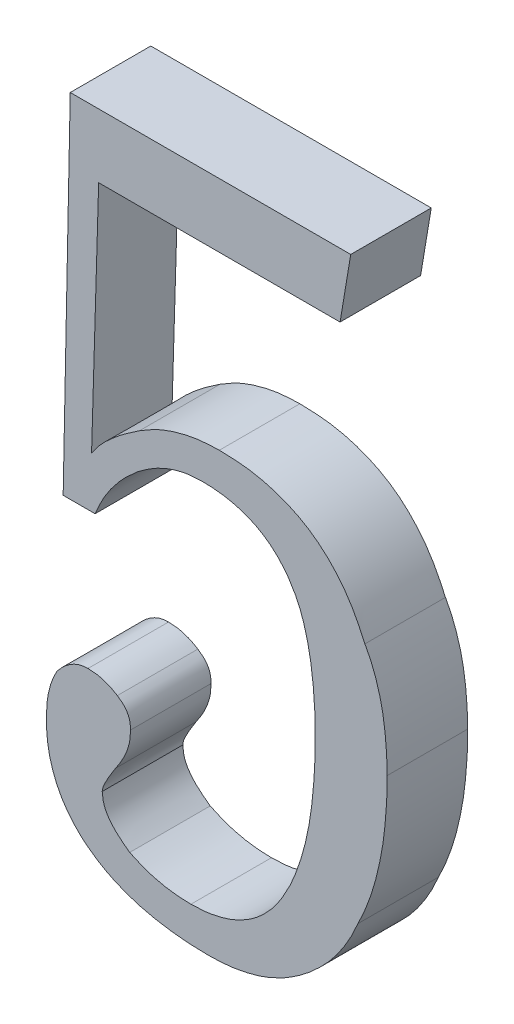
from build123d import *

# Parameters (mm, degrees)
EXTRUDE_1_DEPTH = 3


with BuildPart() as part:
    # Sketch 1 → Extrude 1 (new body)
    with BuildSketch(Plane.XY):
        with BuildLine():
            Line((13.492063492, 23.677248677), (13.095238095, 21.296296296))
            Line((13.095238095, 21.296296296), (4.100529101, 21.296296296))
            Line((4.100529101, 21.296296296), (3.835978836, 12.433862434))
            add(Edge.make_bspline(
                [(3.835978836, 12.433862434), (3.923595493, 12.562751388), (4.114677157, 12.843843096), (4.518514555, 13.231959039), (5.02309314, 13.649741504), (5.414068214, 13.913654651), (5.624142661, 14.055457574)],
                knots=[0, 0, 0, 0, 0.76741166, 1.67363492, 2.750022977, 4, 4, 4, 4], degree=3))
            add(Edge.make_bspline(
                [(5.624142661, 14.055457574), (5.847253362, 14.189219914), (6.291566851, 14.455600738), (7.029185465, 14.712720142), (7.799566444, 14.883943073), (8.329098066, 14.903081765), (8.597883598, 14.912796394)],
                knots=[0, 0, 0, 0, 0.992726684, 1.97696415, 2.973125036, 4, 4, 4, 4], degree=3))
            add(Edge.make_bspline(
                [(8.597883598, 14.912796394), (8.913834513, 14.903625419), (9.524362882, 14.885903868), (10.402872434, 14.716263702), (11.202836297, 14.435941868), (11.933436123, 14.051145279), (12.579934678, 13.543765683), (13.149935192, 12.927085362), (13.639699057, 12.198357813), (13.891373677, 11.655577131), (14.021164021, 11.375661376)],
                knots=[0, 0, 0, 0, 1.095326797, 2.11655688, 3.089621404, 4.027523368, 4.968245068, 5.926481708, 6.930672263, 8, 8, 8, 8], degree=3))
            add(Edge.make_bspline(
                [(14.021164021, 11.375661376), (14.088992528, 11.251125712), (14.226935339, 10.997857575), (14.39043479, 10.587315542), (14.53271169, 10.150413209), (14.651102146, 9.684315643), (14.737184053, 9.18778529), (14.800149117, 8.664488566), (14.840290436, 8.111856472), (14.846112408, 7.734082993), (14.849108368, 7.53968254)],
                knots=[0, 0, 0, 0, 0.857244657, 1.743378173, 2.668156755, 3.636199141, 4.649753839, 5.714636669, 6.823962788, 8, 8, 8, 8], degree=3))
            add(Edge.make_bspline(
                [(14.849108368, 7.53968254), (14.847422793, 7.279901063), (14.844121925, 6.771169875), (14.784842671, 6.024534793), (14.70729465, 5.308861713), (14.581568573, 4.627786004), (14.431293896, 3.977706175), (14.245792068, 3.358165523), (14.021539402, 2.770845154), (13.843957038, 2.397843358), (13.756613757, 2.214383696)],
                knots=[0, 0, 0, 0, 1.136175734, 2.224977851, 3.275120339, 4.284138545, 5.252868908, 6.193122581, 7.111293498, 8, 8, 8, 8], degree=3))
            add(Edge.make_bspline(
                [(13.756613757, 2.214383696), (13.684355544, 2.049678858), (13.54125753, 1.723502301), (13.277461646, 1.261337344), (12.984357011, 0.824499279), (12.655278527, 0.414222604), (12.284476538, 0.039344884), (11.887544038, -0.317643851), (11.450616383, -0.641499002), (11.137218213, -0.83044046), (10.978835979, -0.925925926)],
                knots=[0, 0, 0, 0, 1.010001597, 2.000177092, 2.985066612, 3.963824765, 4.950123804, 5.944541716, 6.961231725, 8, 8, 8, 8], degree=3))
            add(Edge.make_bspline(
                [(10.978835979, -0.925925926), (10.770689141, -1.02856422), (10.350877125, -1.235575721), (9.666886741, -1.433344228), (8.947880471, -1.56909855), (8.453220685, -1.581155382), (8.201058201, -1.587301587)],
                knots=[0, 0, 0, 0, 0.963985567, 1.944265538, 2.952049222, 4, 4, 4, 4], degree=3))
            add(Edge.make_bspline(
                [(8.201058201, -1.587301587), (7.993555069, -1.585049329), (7.587733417, -1.580644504), (6.9957027, -1.529754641), (6.43300477, -1.4517337), (5.900883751, -1.345314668), (5.395850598, -1.208321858), (4.922978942, -1.036867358), (4.476366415, -0.838038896), (4.201939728, -0.673937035), (4.066235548, -0.592788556)],
                knots=[0, 0, 0, 0, 1.155781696, 2.260405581, 3.307755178, 4.319446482, 5.281783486, 6.219991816, 7.119784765, 8, 8, 8, 8], degree=3))
            add(Edge.make_bspline(
                [(4.066235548, -0.592788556), (3.912762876, -0.489155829), (3.612568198, -0.286448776), (3.224631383, 0.082663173), (2.890775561, 0.481927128), (2.619117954, 0.922615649), (2.408538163, 1.401093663), (2.254761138, 1.915717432), (2.166925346, 2.467741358), (2.156193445, 2.847687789), (2.150695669, 3.042328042)],
                knots=[0, 0, 0, 0, 1.031165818, 2.016974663, 2.974313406, 3.927136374, 4.893443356, 5.881773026, 6.91486746, 8, 8, 8, 8], degree=3))
            add(Edge.make_bspline(
                [(2.150695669, 3.042328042), (2.15509842, 3.205928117), (2.163600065, 3.521837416), (2.237195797, 3.976583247), (2.361814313, 4.391304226), (2.486880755, 4.640889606), (2.547521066, 4.761904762)],
                knots=[0, 0, 0, 0, 1.100164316, 2.124400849, 3.090588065, 4, 4, 4, 4], degree=3))
            add(Edge.make_bspline(
                [(2.547521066, 4.761904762), (2.6334783, 4.86241827), (2.795748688, 5.052168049), (3.086684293, 5.259752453), (3.387475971, 5.402917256), (3.599327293, 5.416559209), (3.703703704, 5.423280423)],
                knots=[0, 0, 0, 0, 1.147500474, 2.166255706, 3.096537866, 4, 4, 4, 4], degree=3))
            add(Edge.make_bspline(
                [(3.703703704, 5.423280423), (3.802090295, 5.420122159), (3.996131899, 5.413893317), (4.277936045, 5.346017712), (4.547548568, 5.243496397), (4.71256579, 5.144974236), (4.796198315, 5.095042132)],
                knots=[0, 0, 0, 0, 1.018876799, 2.009465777, 2.991175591, 4, 4, 4, 4], degree=3))
            add(Edge.make_bspline(
                [(4.796198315, 5.095042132), (4.870957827, 5.042902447), (5.014587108, 4.942730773), (5.179887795, 4.738587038), (5.276439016, 4.495482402), (5.286067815, 4.321843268), (5.291005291, 4.232804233)],
                knots=[0, 0, 0, 0, 1.045286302, 2.00822232, 2.978652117, 4, 4, 4, 4], degree=3))
            add(Edge.make_bspline(
                [(5.291005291, 4.232804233), (5.284481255, 4.106311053), (5.271118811, 3.847229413), (5.155678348, 3.463594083), (4.976569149, 3.079433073), (4.812945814, 2.839317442), (4.727611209, 2.714089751)],
                knots=[0, 0, 0, 0, 0.920417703, 1.885187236, 2.897060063, 4, 4, 4, 4], degree=3))
            add(Edge.make_bspline(
                [(4.727611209, 2.714089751), (4.654296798, 2.598892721), (4.522840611, 2.392339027), (4.36792195, 2.110166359), (4.260928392, 1.896326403), (4.240689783, 1.769134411), (4.232804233, 1.71957672)],
                knots=[0, 0, 0, 0, 1.46353964, 2.624195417, 3.463946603, 4, 4, 4, 4], degree=3))
            add(Edge.make_bspline(
                [(4.232804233, 1.71957672), (4.245863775, 1.591548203), (4.273060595, 1.324925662), (4.48733558, 0.94468607), (4.821652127, 0.585823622), (5.103957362, 0.377352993), (5.256711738, 0.264550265)],
                knots=[0, 0, 0, 0, 0.828373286, 1.72510779, 2.769063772, 4, 4, 4, 4], degree=3))
            add(Edge.make_bspline(
                [(5.256711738, 0.264550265), (5.43129636, 0.183257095), (5.782212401, 0.01985738), (6.344601, -0.143736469), (6.933428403, -0.244746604), (7.335132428, -0.25786851), (7.53968254, -0.264550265)],
                knots=[0, 0, 0, 0, 0.976221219, 1.96220997, 2.962345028, 4, 4, 4, 4], degree=3))
            add(Edge.make_bspline(
                [(7.53968254, -0.264550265), (7.721429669, -0.259724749), (8.077637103, -0.25026719), (8.591719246, -0.152393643), (9.075258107, -0.008814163), (9.519618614, 0.207690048), (9.936460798, 0.47522293), (10.307207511, 0.817022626), (10.658581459, 1.202845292), (10.84765286, 1.502388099), (10.944542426, 1.655888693)],
                knots=[0, 0, 0, 0, 1.061184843, 2.079823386, 3.049088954, 4.001280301, 4.959767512, 5.933301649, 6.940921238, 8, 8, 8, 8], degree=3))
            add(Edge.make_bspline(
                [(10.944542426, 1.655888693), (11.044771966, 1.833603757), (11.249387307, 2.196403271), (11.489935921, 2.79245359), (11.700612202, 3.435703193), (11.877548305, 4.130761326), (12.007426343, 4.877885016), (12.098161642, 5.674636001), (12.159283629, 6.522995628), (12.165903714, 7.106817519), (12.169312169, 7.407407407)],
                knots=[0, 0, 0, 0, 0.822466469, 1.679038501, 2.587510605, 3.552750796, 4.569959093, 5.644696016, 6.787334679, 8, 8, 8, 8], degree=3))
            add(Edge.make_bspline(
                [(12.169312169, 7.407407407), (12.167905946, 7.634440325), (12.16518278, 8.074091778), (12.130768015, 8.713258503), (12.071994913, 9.308043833), (11.995401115, 9.861206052), (11.893159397, 10.368234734), (11.770694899, 10.833368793), (11.627655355, 11.256482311), (11.503856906, 11.515497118), (11.444248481, 11.64021164)],
                knots=[0, 0, 0, 0, 1.258107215, 2.436336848, 3.545788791, 4.569701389, 5.529918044, 6.41020937, 7.234522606, 8, 8, 8, 8], degree=3))
            add(Edge.make_bspline(
                [(11.444248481, 11.64021164), (11.35532532, 11.794826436), (11.181223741, 12.097544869), (10.852616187, 12.499054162), (10.478549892, 12.840125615), (10.057009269, 13.117925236), (9.589963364, 13.329174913), (9.079174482, 13.480670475), (8.523039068, 13.575894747), (8.136137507, 13.585228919), (7.936507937, 13.590045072)],
                knots=[0, 0, 0, 0, 1.008035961, 1.973621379, 2.922252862, 3.862928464, 4.818198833, 5.812243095, 6.871183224, 8, 8, 8, 8], degree=3))
            add(Edge.make_bspline(
                [(7.936507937, 13.590045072), (7.729566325, 13.580088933), (7.313828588, 13.560087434), (6.702488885, 13.381990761), (6.104834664, 13.101573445), (5.742556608, 12.835668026), (5.555555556, 12.698412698)],
                knots=[0, 0, 0, 0, 0.956948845, 1.92247342, 2.927620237, 4, 4, 4, 4], degree=3))
            add(Edge.make_bspline(
                [(5.555555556, 12.698412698), (5.377856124, 12.542941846), (5.029783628, 12.238410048), (4.593350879, 11.710378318), (4.226939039, 11.152406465), (4.0540449, 10.748257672), (3.968253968, 10.547717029)],
                knots=[0, 0, 0, 0, 1.047097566, 2.051024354, 3.032908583, 4, 4, 4, 4], degree=3))
            Line((3.968253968, 10.547717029), (2.777777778, 10.547717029))
            Line((2.777777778, 10.547717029), (3.042328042, 23.677248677))
            Line((3.042328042, 23.677248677), (13.492063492, 23.677248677))
        make_face()
    extrude(amount=EXTRUDE_1_DEPTH)


solid = part.part
